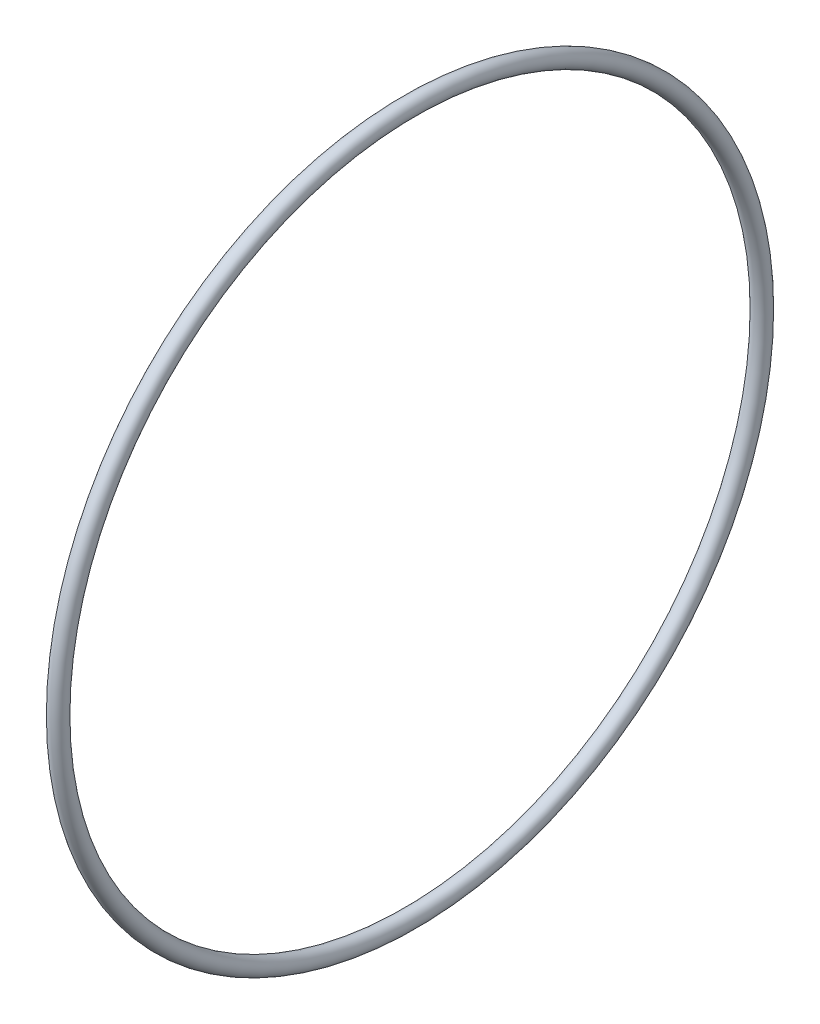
from build123d import *

# Parameters (mm, degrees)
SKETCH1_R = 1.304041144


with BuildPart() as part:
    # Sketch1 → Base-Revolve (revolve)
    with BuildSketch(Plane.XY, mode=Mode.PRIVATE) as base_revolve_sk:
        with Locations((0, 55.118)):
            Circle(SKETCH1_R)
    revolve(base_revolve_sk.sketch.rotate(Axis((0, 0, 0), (1, 0, 0)), 90), axis=Axis((0, 0, 0), (1, 0, 0)))


solid = part.part
